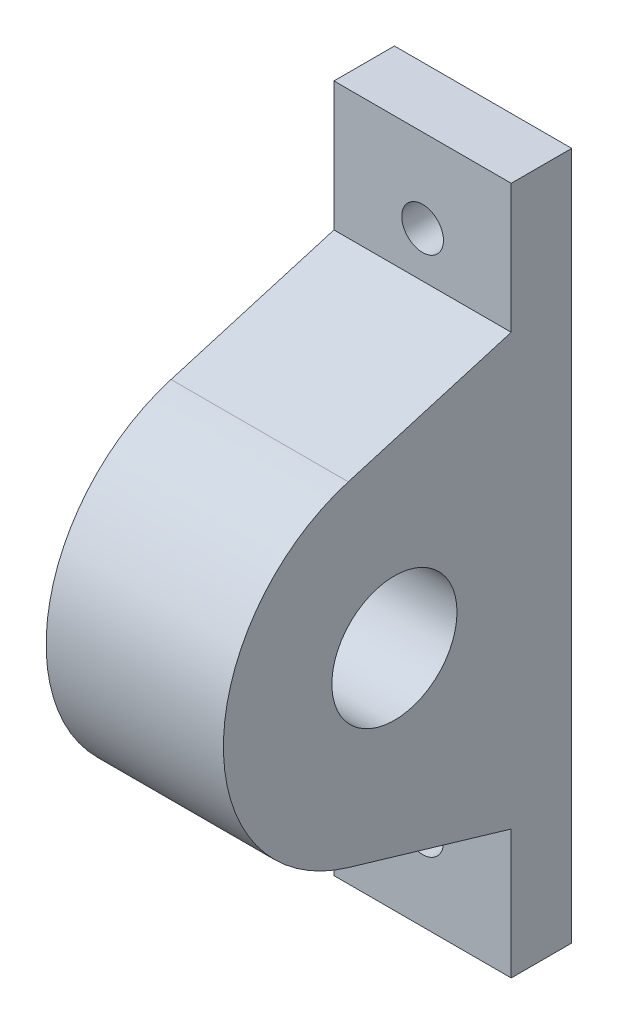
from build123d import *

# Parameters (mm, degrees)
SKETCH1_R           = 30
BOSS_EXTRUDE1_DEPTH = 85
SKETCH2_R           = 10
CUT_EXTRUDE1_DEPTH  = 85


with BuildPart() as part:
    # Sketch1 → Boss-Extrude1 (new body)
    with BuildSketch(Plane.YZ):
        with BuildLine():
            Line((-165, -83.5), (165, -83.5))
            Line((165, -83.5), (165, -54.5))
            Line((165, -54.5), (103.12562301, -54.5))
            Line((103.12562301, -54.5), (80.090474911, 23.617066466))
            ThreePointArc((80.090474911, 23.617066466), (0, 83.5), (-80.090474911, 23.617066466))
            Line((-80.090474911, 23.617066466), (-103.12562301, -54.5))
            Line((-103.12562301, -54.5), (-165, -54.5))
            Line((-165, -54.5), (-165, -83.5))
        make_face()
        with Locations(Location((0, 1.5, 0), (0, 0, 270))):
            Circle(SKETCH1_R, mode=Mode.SUBTRACT)
    extrude(amount=BOSS_EXTRUDE1_DEPTH)

    # Sketch2 → Cut-Extrude1 (cut)
    with BuildSketch(Plane.XY.offset(-54.5)):
        with Locations((42.5, 125)):
            Circle(SKETCH2_R)
        with Locations(Location((42.5, -125, 0), (0, 0, 270))):
            Circle(SKETCH2_R)
    extrude(amount=-CUT_EXTRUDE1_DEPTH, mode=Mode.SUBTRACT)


solid = part.part
